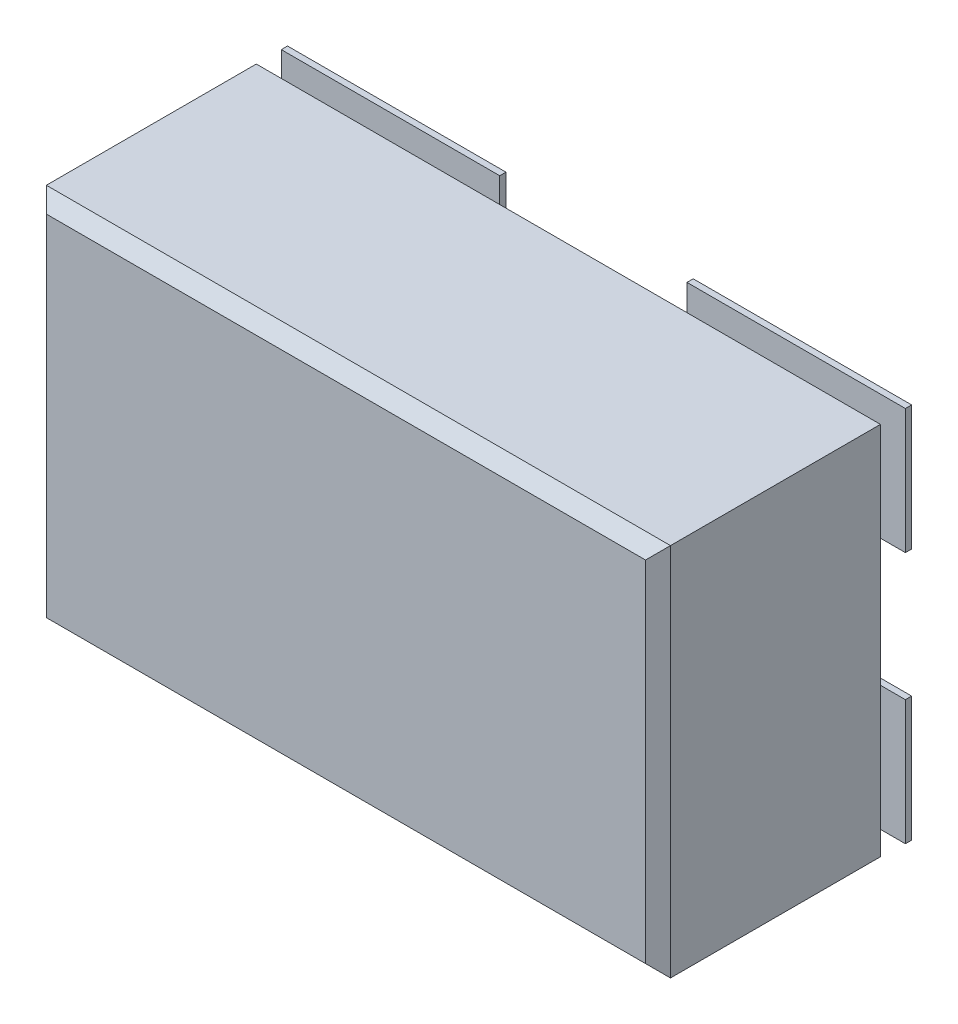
ISO-10303-21;
HEADER;
FILE_DESCRIPTION(('STEP AP214'),'2;1');
FILE_NAME('part.step','',(''),(''),'','','');
FILE_SCHEMA(('AUTOMOTIVE_DESIGN { 1 0 10303 214 1 1 1 1 }'));
ENDSEC;
DATA;
#1=APPLICATION_CONTEXT('core data for automotive mechanical design processes');
#2=APPLICATION_PROTOCOL_DEFINITION('international standard','automotive_design',2000,#1);
#3=PRODUCT_CONTEXT('',#1,'mechanical');
#4=PRODUCT('Part','Part','',(#3));
#5=PRODUCT_RELATED_PRODUCT_CATEGORY('part','',(#4));
#6=PRODUCT_DEFINITION_FORMATION('','',#4);
#7=PRODUCT_DEFINITION_CONTEXT('part definition',#1,'design');
#8=PRODUCT_DEFINITION('design','',#6,#7);
#9=PRODUCT_DEFINITION_SHAPE('','',#8);
#10=(LENGTH_UNIT() NAMED_UNIT(*) SI_UNIT(.MILLI.,.METRE.));
#11=(NAMED_UNIT(*) PLANE_ANGLE_UNIT() SI_UNIT($,.RADIAN.));
#12=(NAMED_UNIT(*) SI_UNIT($,.STERADIAN.) SOLID_ANGLE_UNIT());
#13=UNCERTAINTY_MEASURE_WITH_UNIT(LENGTH_MEASURE(1.E-05),#10,'distance_accuracy_value','');
#14=(GEOMETRIC_REPRESENTATION_CONTEXT(3) GLOBAL_UNCERTAINTY_ASSIGNED_CONTEXT((#13)) GLOBAL_UNIT_ASSIGNED_CONTEXT((#10,
#11,#12)) REPRESENTATION_CONTEXT('',''));
#15=CARTESIAN_POINT('',(0.,0.,0.));
#16=DIRECTION('',(0.,0.,1.));
#17=DIRECTION('',(1.,0.,0.));
#18=AXIS2_PLACEMENT_3D('',#15,#16,#17);
#19=CARTESIAN_POINT('',(0.,0.,0.0762));
#20=DIRECTION('',(0.,0.,1.));
#21=DIRECTION('',(1.,0.,0.));
#22=AXIS2_PLACEMENT_3D('',#19,#20,#21);
#23=PLANE('',#22);
#24=DIRECTION('',(1.,0.,0.));
#25=VECTOR('',#24,1.);
#26=CARTESIAN_POINT('',(-0.500000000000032,-0.30000000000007,0.0762));
#27=LINE('',#26,#25);
#28=CARTESIAN_POINT('',(-0.500000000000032,-0.30000000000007,0.0762));
#29=VERTEX_POINT('',#28);
#30=CARTESIAN_POINT('',(-0.15000000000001,-0.30000000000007,0.0762));
#31=VERTEX_POINT('',#30);
#32=EDGE_CURVE('E504',#29,#31,#27,.T.);
#33=ORIENTED_EDGE('',*,*,#32,.F.);
#34=DIRECTION('',(0.,1.,0.));
#35=VECTOR('',#34,1.);
#36=CARTESIAN_POINT('',(-0.500000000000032,0.30000000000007,0.0762));
#37=LINE('',#36,#35);
#38=CARTESIAN_POINT('',(-0.500000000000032,0.30000000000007,0.0762));
#39=VERTEX_POINT('',#38);
#40=EDGE_CURVE('E509',#39,#29,#37,.F.);
#41=ORIENTED_EDGE('',*,*,#40,.F.);
#42=DIRECTION('',(1.,0.,0.));
#43=VECTOR('',#42,1.);
#44=CARTESIAN_POINT('',(-0.15000000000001,0.30000000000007,0.0762));
#45=LINE('',#44,#43);
#46=CARTESIAN_POINT('',(-0.15000000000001,0.30000000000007,0.0762));
#47=VERTEX_POINT('',#46);
#48=EDGE_CURVE('E471',#47,#39,#45,.F.);
#49=ORIENTED_EDGE('',*,*,#48,.F.);
#50=DIRECTION('',(0.,1.,0.));
#51=VECTOR('',#50,1.);
#52=CARTESIAN_POINT('',(-0.15000000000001,-0.30000000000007,0.0762));
#53=LINE('',#52,#51);
#54=EDGE_CURVE('E499',#31,#47,#53,.T.);
#55=ORIENTED_EDGE('',*,*,#54,.F.);
#56=EDGE_LOOP('',(#33,#41,#49,#55));
#57=FACE_BOUND('',#56,.T.);
#58=ADVANCED_FACE('F16',(#57),#23,.F.);
#59=CARTESIAN_POINT('',(-0.500000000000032,0.30000000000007,0.0762));
#60=DIRECTION('',(-1.,0.,0.));
#61=DIRECTION('',(0.,0.,1.));
#62=AXIS2_PLACEMENT_3D('',#59,#60,#61);
#63=PLANE('',#62);
#64=DIRECTION('',(0.,0.,1.));
#65=VECTOR('',#64,1.);
#66=CARTESIAN_POINT('',(-0.500000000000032,0.30000000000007,0.0762));
#67=LINE('',#66,#65);
#68=CARTESIAN_POINT('',(-0.500000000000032,0.30000000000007,0.0862000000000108));
#69=VERTEX_POINT('',#68);
#70=EDGE_CURVE('E496',#39,#69,#67,.T.);
#71=ORIENTED_EDGE('',*,*,#70,.F.);
#72=ORIENTED_EDGE('',*,*,#40,.T.);
#73=DIRECTION('',(0.,0.,-1.));
#74=VECTOR('',#73,1.);
#75=CARTESIAN_POINT('',(-0.500000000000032,-0.30000000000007,0.0762));
#76=LINE('',#75,#74);
#77=CARTESIAN_POINT('',(-0.500000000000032,-0.30000000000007,0.0862000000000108));
#78=VERTEX_POINT('',#77);
#79=EDGE_CURVE('E506',#78,#29,#76,.T.);
#80=ORIENTED_EDGE('',*,*,#79,.F.);
#81=DIRECTION('',(0.,1.,0.));
#82=VECTOR('',#81,1.);
#83=CARTESIAN_POINT('',(-0.500000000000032,0.,0.0862000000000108));
#84=LINE('',#83,#82);
#85=EDGE_CURVE('E406',#69,#78,#84,.F.);
#86=ORIENTED_EDGE('',*,*,#85,.F.);
#87=EDGE_LOOP('',(#71,#72,#80,#86));
#88=FACE_BOUND('',#87,.T.);
#89=ADVANCED_FACE('F1031',(#88),#63,.T.);
#90=CARTESIAN_POINT('',(-0.500000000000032,-0.30000000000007,0.0762));
#91=DIRECTION('',(0.,-1.,0.));
#92=DIRECTION('',(0.,0.,-1.));
#93=AXIS2_PLACEMENT_3D('',#90,#91,#92);
#94=PLANE('',#93);
#95=ORIENTED_EDGE('',*,*,#79,.T.);
#96=ORIENTED_EDGE('',*,*,#32,.T.);
#97=DIRECTION('',(0.,0.,-1.));
#98=VECTOR('',#97,1.);
#99=CARTESIAN_POINT('',(-0.15000000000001,-0.30000000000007,0.0762));
#100=LINE('',#99,#98);
#101=CARTESIAN_POINT('',(-0.15000000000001,-0.30000000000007,0.0862000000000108));
#102=VERTEX_POINT('',#101);
#103=EDGE_CURVE('E501',#102,#31,#100,.T.);
#104=ORIENTED_EDGE('',*,*,#103,.F.);
#105=DIRECTION('',(1.,0.,0.));
#106=VECTOR('',#105,1.);
#107=CARTESIAN_POINT('',(0.,-0.30000000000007,0.0862000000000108));
#108=LINE('',#107,#106);
#109=EDGE_CURVE('E403',#78,#102,#108,.T.);
#110=ORIENTED_EDGE('',*,*,#109,.F.);
#111=EDGE_LOOP('',(#95,#96,#104,#110));
#112=FACE_BOUND('',#111,.T.);
#113=ADVANCED_FACE('F1021',(#112),#94,.T.);
#114=CARTESIAN_POINT('',(-0.15000000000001,-0.30000000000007,0.0762));
#115=DIRECTION('',(1.,0.,0.));
#116=DIRECTION('',(0.,0.,-1.));
#117=AXIS2_PLACEMENT_3D('',#114,#115,#116);
#118=PLANE('',#117);
#119=ORIENTED_EDGE('',*,*,#103,.T.);
#120=ORIENTED_EDGE('',*,*,#54,.T.);
#121=DIRECTION('',(0.,0.,1.));
#122=VECTOR('',#121,1.);
#123=CARTESIAN_POINT('',(-0.15000000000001,0.30000000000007,0.0762));
#124=LINE('',#123,#122);
#125=CARTESIAN_POINT('',(-0.15000000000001,0.30000000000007,0.0862000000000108));
#126=VERTEX_POINT('',#125);
#127=EDGE_CURVE('E493',#126,#47,#124,.F.);
#128=ORIENTED_EDGE('',*,*,#127,.F.);
#129=DIRECTION('',(0.,1.,0.));
#130=VECTOR('',#129,1.);
#131=CARTESIAN_POINT('',(-0.15000000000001,0.,0.0862000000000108));
#132=LINE('',#131,#130);
#133=EDGE_CURVE('E400',#102,#126,#132,.T.);
#134=ORIENTED_EDGE('',*,*,#133,.F.);
#135=EDGE_LOOP('',(#119,#120,#128,#134));
#136=FACE_BOUND('',#135,.T.);
#137=ADVANCED_FACE('F1011',(#136),#118,.T.);
#138=CARTESIAN_POINT('',(-0.15000000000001,0.30000000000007,0.0762));
#139=DIRECTION('',(0.,1.,0.));
#140=DIRECTION('',(0.,0.,1.));
#141=AXIS2_PLACEMENT_3D('',#138,#139,#140);
#142=PLANE('',#141);
#143=ORIENTED_EDGE('',*,*,#127,.T.);
#144=ORIENTED_EDGE('',*,*,#48,.T.);
#145=ORIENTED_EDGE('',*,*,#70,.T.);
#146=DIRECTION('',(1.,0.,0.));
#147=VECTOR('',#146,1.);
#148=CARTESIAN_POINT('',(0.,0.30000000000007,0.0862000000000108));
#149=LINE('',#148,#147);
#150=EDGE_CURVE('E396',#126,#69,#149,.F.);
#151=ORIENTED_EDGE('',*,*,#150,.F.);
#152=EDGE_LOOP('',(#143,#144,#145,#151));
#153=FACE_BOUND('',#152,.T.);
#154=ADVANCED_FACE('F1001',(#153),#142,.T.);
#155=CARTESIAN_POINT('',(0.500000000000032,0.101999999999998,0.0762));
#156=DIRECTION('',(1.,0.,0.));
#157=DIRECTION('',(0.,0.,-1.));
#158=AXIS2_PLACEMENT_3D('',#155,#156,#157);
#159=PLANE('',#158);
#160=DIRECTION('',(0.,0.,-1.));
#161=VECTOR('',#160,1.);
#162=CARTESIAN_POINT('',(0.500000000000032,0.101999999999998,0.0762));
#163=LINE('',#162,#161);
#164=CARTESIAN_POINT('',(0.500000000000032,0.101999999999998,0.0762));
#165=VERTEX_POINT('',#164);
#166=CARTESIAN_POINT('',(0.500000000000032,0.101999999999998,0.0862000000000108));
#167=VERTEX_POINT('',#166);
#168=EDGE_CURVE('E399',#165,#167,#163,.F.);
#169=ORIENTED_EDGE('',*,*,#168,.F.);
#170=DIRECTION('',(0.,1.,0.));
#171=VECTOR('',#170,1.);
#172=CARTESIAN_POINT('',(0.500000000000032,0.,0.0762));
#173=LINE('',#172,#171);
#174=CARTESIAN_POINT('',(0.500000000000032,0.302000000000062,0.0762));
#175=VERTEX_POINT('',#174);
#176=EDGE_CURVE('E247',#165,#175,#173,.T.);
#177=ORIENTED_EDGE('',*,*,#176,.T.);
#178=DIRECTION('',(0.,0.,1.));
#179=VECTOR('',#178,1.);
#180=CARTESIAN_POINT('',(0.500000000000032,0.302000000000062,0.0762));
#181=LINE('',#180,#179);
#182=CARTESIAN_POINT('',(0.500000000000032,0.302000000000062,0.0862000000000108));
#183=VERTEX_POINT('',#182);
#184=EDGE_CURVE('E462',#183,#175,#181,.F.);
#185=ORIENTED_EDGE('',*,*,#184,.F.);
#186=DIRECTION('',(0.,1.,0.));
#187=VECTOR('',#186,1.);
#188=CARTESIAN_POINT('',(0.500000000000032,0.,0.0862000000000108));
#189=LINE('',#188,#187);
#190=EDGE_CURVE('E389',#167,#183,#189,.T.);
#191=ORIENTED_EDGE('',*,*,#190,.F.);
#192=EDGE_LOOP('',(#169,#177,#185,#191));
#193=FACE_BOUND('',#192,.T.);
#194=ADVANCED_FACE('F991',(#193),#159,.T.);
#195=CARTESIAN_POINT('',(0.500000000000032,0.302000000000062,0.0762));
#196=DIRECTION('',(0.,1.,0.));
#197=DIRECTION('',(0.,0.,1.));
#198=AXIS2_PLACEMENT_3D('',#195,#196,#197);
#199=PLANE('',#198);
#200=ORIENTED_EDGE('',*,*,#184,.T.);
#201=DIRECTION('',(1.,0.,0.));
#202=VECTOR('',#201,1.);
#203=CARTESIAN_POINT('',(0.,0.302000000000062,0.0762));
#204=LINE('',#203,#202);
#205=CARTESIAN_POINT('',(0.15000000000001,0.302000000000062,0.0762));
#206=VERTEX_POINT('',#205);
#207=EDGE_CURVE('E482',#175,#206,#204,.F.);
#208=ORIENTED_EDGE('',*,*,#207,.T.);
#209=DIRECTION('',(0.,0.,1.));
#210=VECTOR('',#209,1.);
#211=CARTESIAN_POINT('',(0.15000000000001,0.302000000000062,0.0762));
#212=LINE('',#211,#210);
#213=CARTESIAN_POINT('',(0.15000000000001,0.302000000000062,0.0862000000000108));
#214=VERTEX_POINT('',#213);
#215=EDGE_CURVE('E431',#214,#206,#212,.F.);
#216=ORIENTED_EDGE('',*,*,#215,.F.);
#217=DIRECTION('',(1.,0.,0.));
#218=VECTOR('',#217,1.);
#219=CARTESIAN_POINT('',(0.,0.302000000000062,0.0862000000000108));
#220=LINE('',#219,#218);
#221=EDGE_CURVE('E457',#183,#214,#220,.F.);
#222=ORIENTED_EDGE('',*,*,#221,.F.);
#223=EDGE_LOOP('',(#200,#208,#216,#222));
#224=FACE_BOUND('',#223,.T.);
#225=ADVANCED_FACE('F981',(#224),#199,.T.);
#226=CARTESIAN_POINT('',(0.15000000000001,0.302000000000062,0.0762));
#227=DIRECTION('',(-1.,0.,0.));
#228=DIRECTION('',(0.,0.,1.));
#229=AXIS2_PLACEMENT_3D('',#226,#227,#228);
#230=PLANE('',#229);
#231=ORIENTED_EDGE('',*,*,#215,.T.);
#232=DIRECTION('',(0.,1.,0.));
#233=VECTOR('',#232,1.);
#234=CARTESIAN_POINT('',(0.15000000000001,0.,0.0762));
#235=LINE('',#234,#233);
#236=CARTESIAN_POINT('',(0.15000000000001,0.101999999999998,0.0762));
#237=VERTEX_POINT('',#236);
#238=EDGE_CURVE('E365',#206,#237,#235,.F.);
#239=ORIENTED_EDGE('',*,*,#238,.T.);
#240=DIRECTION('',(0.,0.,-1.));
#241=VECTOR('',#240,1.);
#242=CARTESIAN_POINT('',(0.15000000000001,0.101999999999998,0.0762));
#243=LINE('',#242,#241);
#244=CARTESIAN_POINT('',(0.15000000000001,0.101999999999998,0.0862000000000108));
#245=VERTEX_POINT('',#244);
#246=EDGE_CURVE('E249',#245,#237,#243,.T.);
#247=ORIENTED_EDGE('',*,*,#246,.F.);
#248=DIRECTION('',(0.,1.,0.));
#249=VECTOR('',#248,1.);
#250=CARTESIAN_POINT('',(0.15000000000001,0.,0.0862000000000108));
#251=LINE('',#250,#249);
#252=EDGE_CURVE('E374',#214,#245,#251,.F.);
#253=ORIENTED_EDGE('',*,*,#252,.F.);
#254=EDGE_LOOP('',(#231,#239,#247,#253));
#255=FACE_BOUND('',#254,.T.);
#256=ADVANCED_FACE('F971',(#255),#230,.T.);
#257=CARTESIAN_POINT('',(0.15000000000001,-0.101999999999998,0.0762));
#258=DIRECTION('',(-1.,0.,0.));
#259=DIRECTION('',(0.,0.,1.));
#260=AXIS2_PLACEMENT_3D('',#257,#258,#259);
#261=PLANE('',#260);
#262=DIRECTION('',(0.,0.,1.));
#263=VECTOR('',#262,1.);
#264=CARTESIAN_POINT('',(0.15000000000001,-0.101999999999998,0.0762));
#265=LINE('',#264,#263);
#266=CARTESIAN_POINT('',(0.15000000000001,-0.101999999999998,0.0762));
#267=VERTEX_POINT('',#266);
#268=CARTESIAN_POINT('',(0.15000000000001,-0.101999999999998,0.0862000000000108));
#269=VERTEX_POINT('',#268);
#270=EDGE_CURVE('E295',#267,#269,#265,.T.);
#271=ORIENTED_EDGE('',*,*,#270,.F.);
#272=DIRECTION('',(0.,1.,0.));
#273=VECTOR('',#272,1.);
#274=CARTESIAN_POINT('',(0.15000000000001,0.,0.0762));
#275=LINE('',#274,#273);
#276=CARTESIAN_POINT('',(0.15000000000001,-0.302000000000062,0.0762));
#277=VERTEX_POINT('',#276);
#278=EDGE_CURVE('E412',#267,#277,#275,.F.);
#279=ORIENTED_EDGE('',*,*,#278,.T.);
#280=DIRECTION('',(0.,0.,-1.));
#281=VECTOR('',#280,1.);
#282=CARTESIAN_POINT('',(0.15000000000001,-0.302000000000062,0.0762));
#283=LINE('',#282,#281);
#284=CARTESIAN_POINT('',(0.15000000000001,-0.302000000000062,0.0862000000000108));
#285=VERTEX_POINT('',#284);
#286=EDGE_CURVE('E422',#285,#277,#283,.T.);
#287=ORIENTED_EDGE('',*,*,#286,.F.);
#288=DIRECTION('',(0.,1.,0.));
#289=VECTOR('',#288,1.);
#290=CARTESIAN_POINT('',(0.15000000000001,0.,0.0862000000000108));
#291=LINE('',#290,#289);
#292=EDGE_CURVE('E308',#269,#285,#291,.F.);
#293=ORIENTED_EDGE('',*,*,#292,.F.);
#294=EDGE_LOOP('',(#271,#279,#287,#293));
#295=FACE_BOUND('',#294,.T.);
#296=ADVANCED_FACE('F961',(#295),#261,.T.);
#297=CARTESIAN_POINT('',(0.15000000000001,-0.302000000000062,0.0762));
#298=DIRECTION('',(0.,-1.,0.));
#299=DIRECTION('',(0.,0.,-1.));
#300=AXIS2_PLACEMENT_3D('',#297,#298,#299);
#301=PLANE('',#300);
#302=ORIENTED_EDGE('',*,*,#286,.T.);
#303=DIRECTION('',(1.,0.,0.));
#304=VECTOR('',#303,1.);
#305=CARTESIAN_POINT('',(0.,-0.302000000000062,0.0762));
#306=LINE('',#305,#304);
#307=CARTESIAN_POINT('',(0.500000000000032,-0.302000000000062,0.0762));
#308=VERTEX_POINT('',#307);
#309=EDGE_CURVE('E442',#277,#308,#306,.T.);
#310=ORIENTED_EDGE('',*,*,#309,.T.);
#311=DIRECTION('',(0.,0.,-1.));
#312=VECTOR('',#311,1.);
#313=CARTESIAN_POINT('',(0.500000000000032,-0.302000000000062,0.0762));
#314=LINE('',#313,#312);
#315=CARTESIAN_POINT('',(0.500000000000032,-0.302000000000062,0.0862000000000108));
#316=VERTEX_POINT('',#315);
#317=EDGE_CURVE('E409',#316,#308,#314,.T.);
#318=ORIENTED_EDGE('',*,*,#317,.F.);
#319=DIRECTION('',(1.,0.,0.));
#320=VECTOR('',#319,1.);
#321=CARTESIAN_POINT('',(0.,-0.302000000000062,0.0862000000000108));
#322=LINE('',#321,#320);
#323=EDGE_CURVE('E417',#285,#316,#322,.T.);
#324=ORIENTED_EDGE('',*,*,#323,.F.);
#325=EDGE_LOOP('',(#302,#310,#318,#324));
#326=FACE_BOUND('',#325,.T.);
#327=ADVANCED_FACE('F951',(#326),#301,.T.);
#328=CARTESIAN_POINT('',(0.500000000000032,-0.302000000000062,0.0762));
#329=DIRECTION('',(1.,0.,0.));
#330=DIRECTION('',(0.,0.,-1.));
#331=AXIS2_PLACEMENT_3D('',#328,#329,#330);
#332=PLANE('',#331);
#333=ORIENTED_EDGE('',*,*,#317,.T.);
#334=DIRECTION('',(0.,1.,0.));
#335=VECTOR('',#334,1.);
#336=CARTESIAN_POINT('',(0.500000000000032,0.,0.0762));
#337=LINE('',#336,#335);
#338=CARTESIAN_POINT('',(0.500000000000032,-0.101999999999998,0.0762));
#339=VERTEX_POINT('',#338);
#340=EDGE_CURVE('E312',#308,#339,#337,.T.);
#341=ORIENTED_EDGE('',*,*,#340,.T.);
#342=DIRECTION('',(0.,0.,1.));
#343=VECTOR('',#342,1.);
#344=CARTESIAN_POINT('',(0.500000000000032,-0.101999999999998,0.0762));
#345=LINE('',#344,#343);
#346=CARTESIAN_POINT('',(0.500000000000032,-0.101999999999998,0.0862000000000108));
#347=VERTEX_POINT('',#346);
#348=EDGE_CURVE('E373',#347,#339,#345,.F.);
#349=ORIENTED_EDGE('',*,*,#348,.F.);
#350=DIRECTION('',(0.,1.,0.));
#351=VECTOR('',#350,1.);
#352=CARTESIAN_POINT('',(0.500000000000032,0.,0.0862000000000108));
#353=LINE('',#352,#351);
#354=EDGE_CURVE('E343',#316,#347,#353,.T.);
#355=ORIENTED_EDGE('',*,*,#354,.F.);
#356=EDGE_LOOP('',(#333,#341,#349,#355));
#357=FACE_BOUND('',#356,.T.);
#358=ADVANCED_FACE('F941',(#357),#332,.T.);
#359=CARTESIAN_POINT('',(0.,0.,0.0862000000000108));
#360=DIRECTION('',(0.,0.,1.));
#361=DIRECTION('',(1.,0.,0.));
#362=AXIS2_PLACEMENT_3D('',#359,#360,#361);
#363=PLANE('',#362);
#364=DIRECTION('',(1.,0.,0.));
#365=VECTOR('',#364,1.);
#366=CARTESIAN_POINT('',(-0.449999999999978,-0.249999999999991,0.0862000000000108));
#367=LINE('',#366,#365);
#368=CARTESIAN_POINT('',(-0.449999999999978,-0.249999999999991,0.0862000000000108));
#369=VERTEX_POINT('',#368);
#370=CARTESIAN_POINT('',(-0.199999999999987,-0.249999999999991,0.0862000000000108));
#371=VERTEX_POINT('',#370);
#372=EDGE_CURVE('E289',#369,#371,#367,.T.);
#373=ORIENTED_EDGE('',*,*,#372,.F.);
#374=DIRECTION('',(0.,1.,0.));
#375=VECTOR('',#374,1.);
#376=CARTESIAN_POINT('',(-0.449999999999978,0.249999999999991,0.0862000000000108));
#377=LINE('',#376,#375);
#378=CARTESIAN_POINT('',(-0.449999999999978,0.249999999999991,0.0862000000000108));
#379=VERTEX_POINT('',#378);
#380=EDGE_CURVE('E264',#379,#369,#377,.F.);
#381=ORIENTED_EDGE('',*,*,#380,.F.);
#382=DIRECTION('',(1.,0.,0.));
#383=VECTOR('',#382,1.);
#384=CARTESIAN_POINT('',(-0.199999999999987,0.249999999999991,0.0862000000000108));
#385=LINE('',#384,#383);
#386=CARTESIAN_POINT('',(-0.199999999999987,0.249999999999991,0.0862000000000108));
#387=VERTEX_POINT('',#386);
#388=EDGE_CURVE('E279',#387,#379,#385,.F.);
#389=ORIENTED_EDGE('',*,*,#388,.F.);
#390=DIRECTION('',(0.,1.,0.));
#391=VECTOR('',#390,1.);
#392=CARTESIAN_POINT('',(-0.199999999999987,-0.249999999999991,0.0862000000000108));
#393=LINE('',#392,#391);
#394=EDGE_CURVE('E284',#371,#387,#393,.T.);
#395=ORIENTED_EDGE('',*,*,#394,.F.);
#396=EDGE_LOOP('',(#373,#381,#389,#395));
#397=FACE_BOUND('',#396,.T.);
#398=ORIENTED_EDGE('',*,*,#133,.T.);
#399=ORIENTED_EDGE('',*,*,#150,.T.);
#400=ORIENTED_EDGE('',*,*,#85,.T.);
#401=ORIENTED_EDGE('',*,*,#109,.T.);
#402=EDGE_LOOP('',(#398,#399,#400,#401));
#403=FACE_BOUND('',#402,.T.);
#404=ADVANCED_FACE('F932',(#397,#403),#363,.T.);
#405=CARTESIAN_POINT('',(0.15000000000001,0.101999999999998,0.0762));
#406=DIRECTION('',(0.,-1.,0.));
#407=DIRECTION('',(0.,0.,-1.));
#408=AXIS2_PLACEMENT_3D('',#405,#406,#407);
#409=PLANE('',#408);
#410=DIRECTION('',(1.,0.,0.));
#411=VECTOR('',#410,1.);
#412=CARTESIAN_POINT('',(0.,0.101999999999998,0.0862000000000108));
#413=LINE('',#412,#411);
#414=CARTESIAN_POINT('',(0.449999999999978,0.101999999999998,0.0862000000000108));
#415=VERTEX_POINT('',#414);
#416=EDGE_CURVE('E255',#415,#167,#413,.T.);
#417=ORIENTED_EDGE('',*,*,#416,.F.);
#418=DIRECTION('',(0.,0.,-1.));
#419=VECTOR('',#418,1.);
#420=CARTESIAN_POINT('',(0.449999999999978,0.101999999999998,0.0762));
#421=LINE('',#420,#419);
#422=CARTESIAN_POINT('',(0.449999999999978,0.101999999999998,0.0762));
#423=VERTEX_POINT('',#422);
#424=EDGE_CURVE('E252',#423,#415,#421,.F.);
#425=ORIENTED_EDGE('',*,*,#424,.F.);
#426=DIRECTION('',(1.,0.,0.));
#427=VECTOR('',#426,1.);
#428=CARTESIAN_POINT('',(0.,0.101999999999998,0.0762));
#429=LINE('',#428,#427);
#430=EDGE_CURVE('E240',#423,#165,#429,.T.);
#431=ORIENTED_EDGE('',*,*,#430,.T.);
#432=ORIENTED_EDGE('',*,*,#168,.T.);
#433=EDGE_LOOP('',(#417,#425,#431,#432));
#434=FACE_BOUND('',#433,.T.);
#435=ADVANCED_FACE('F253',(#434),#409,.T.);
#436=CARTESIAN_POINT('',(0.15000000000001,0.101999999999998,0.0762));
#437=DIRECTION('',(0.,-1.,0.));
#438=DIRECTION('',(0.,0.,-1.));
#439=AXIS2_PLACEMENT_3D('',#436,#437,#438);
#440=PLANE('',#439);
#441=DIRECTION('',(1.,0.,0.));
#442=VECTOR('',#441,1.);
#443=CARTESIAN_POINT('',(0.,0.101999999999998,0.0762));
#444=LINE('',#443,#442);
#445=CARTESIAN_POINT('',(0.199999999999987,0.101999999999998,0.0762));
#446=VERTEX_POINT('',#445);
#447=EDGE_CURVE('E363',#237,#446,#444,.T.);
#448=ORIENTED_EDGE('',*,*,#447,.T.);
#449=DIRECTION('',(0.,0.,1.));
#450=VECTOR('',#449,1.);
#451=CARTESIAN_POINT('',(0.199999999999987,0.101999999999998,0.0762));
#452=LINE('',#451,#450);
#453=CARTESIAN_POINT('',(0.199999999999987,0.101999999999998,0.0862000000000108));
#454=VERTEX_POINT('',#453);
#455=EDGE_CURVE('E517',#454,#446,#452,.F.);
#456=ORIENTED_EDGE('',*,*,#455,.F.);
#457=DIRECTION('',(1.,0.,0.));
#458=VECTOR('',#457,1.);
#459=CARTESIAN_POINT('',(0.,0.101999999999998,0.0862000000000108));
#460=LINE('',#459,#458);
#461=EDGE_CURVE('E370',#245,#454,#460,.T.);
#462=ORIENTED_EDGE('',*,*,#461,.F.);
#463=ORIENTED_EDGE('',*,*,#246,.T.);
#464=EDGE_LOOP('',(#448,#456,#462,#463));
#465=FACE_BOUND('',#464,.T.);
#466=ADVANCED_FACE('F914',(#465),#440,.T.);
#467=CARTESIAN_POINT('',(0.,0.,0.0762));
#468=DIRECTION('',(0.,0.,1.));
#469=DIRECTION('',(1.,0.,0.));
#470=AXIS2_PLACEMENT_3D('',#467,#468,#469);
#471=PLANE('',#470);
#472=DIRECTION('',(0.,1.,0.));
#473=VECTOR('',#472,1.);
#474=CARTESIAN_POINT('',(0.199999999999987,0.249999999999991,0.0762));
#475=LINE('',#474,#473);
#476=CARTESIAN_POINT('',(0.199999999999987,0.100000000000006,0.0762));
#477=VERTEX_POINT('',#476);
#478=EDGE_CURVE('E514',#446,#477,#475,.F.);
#479=ORIENTED_EDGE('',*,*,#478,.F.);
#480=ORIENTED_EDGE('',*,*,#447,.F.);
#481=ORIENTED_EDGE('',*,*,#238,.F.);
#482=ORIENTED_EDGE('',*,*,#207,.F.);
#483=ORIENTED_EDGE('',*,*,#176,.F.);
#484=ORIENTED_EDGE('',*,*,#430,.F.);
#485=DIRECTION('',(0.,1.,0.));
#486=VECTOR('',#485,1.);
#487=CARTESIAN_POINT('',(0.449999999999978,0.100000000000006,0.0762));
#488=LINE('',#487,#486);
#489=CARTESIAN_POINT('',(0.449999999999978,0.100000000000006,0.0762));
#490=VERTEX_POINT('',#489);
#491=EDGE_CURVE('E19',#490,#423,#488,.T.);
#492=ORIENTED_EDGE('',*,*,#491,.F.);
#493=DIRECTION('',(1.,0.,0.));
#494=VECTOR('',#493,1.);
#495=CARTESIAN_POINT('',(0.199999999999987,0.100000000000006,0.0762));
#496=LINE('',#495,#494);
#497=EDGE_CURVE('E234',#477,#490,#496,.T.);
#498=ORIENTED_EDGE('',*,*,#497,.F.);
#499=EDGE_LOOP('',(#479,#480,#481,#482,#483,#484,#492,#498));
#500=FACE_BOUND('',#499,.T.);
#501=ADVANCED_FACE('F243',(#500),#471,.F.);
#502=CARTESIAN_POINT('',(0.,0.,0.0862000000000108));
#503=DIRECTION('',(0.,0.,1.));
#504=DIRECTION('',(1.,0.,0.));
#505=AXIS2_PLACEMENT_3D('',#502,#503,#504);
#506=PLANE('',#505);
#507=ORIENTED_EDGE('',*,*,#461,.T.);
#508=DIRECTION('',(0.,1.,0.));
#509=VECTOR('',#508,1.);
#510=CARTESIAN_POINT('',(0.199999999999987,0.249999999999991,0.0862000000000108));
#511=LINE('',#510,#509);
#512=CARTESIAN_POINT('',(0.199999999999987,0.249999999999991,0.0862000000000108));
#513=VERTEX_POINT('',#512);
#514=EDGE_CURVE('E377',#513,#454,#511,.F.);
#515=ORIENTED_EDGE('',*,*,#514,.F.);
#516=DIRECTION('',(1.,0.,0.));
#517=VECTOR('',#516,1.);
#518=CARTESIAN_POINT('',(0.449999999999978,0.249999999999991,0.0862000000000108));
#519=LINE('',#518,#517);
#520=CARTESIAN_POINT('',(0.449999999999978,0.249999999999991,0.0862000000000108));
#521=VERTEX_POINT('',#520);
#522=EDGE_CURVE('E522',#521,#513,#519,.F.);
#523=ORIENTED_EDGE('',*,*,#522,.F.);
#524=DIRECTION('',(0.,1.,0.));
#525=VECTOR('',#524,1.);
#526=CARTESIAN_POINT('',(0.449999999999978,0.100000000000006,0.0862000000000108));
#527=LINE('',#526,#525);
#528=EDGE_CURVE('E258',#415,#521,#527,.T.);
#529=ORIENTED_EDGE('',*,*,#528,.F.);
#530=ORIENTED_EDGE('',*,*,#416,.T.);
#531=ORIENTED_EDGE('',*,*,#190,.T.);
#532=ORIENTED_EDGE('',*,*,#221,.T.);
#533=ORIENTED_EDGE('',*,*,#252,.T.);
#534=EDGE_LOOP('',(#507,#515,#523,#529,#530,#531,#532,#533));
#535=FACE_BOUND('',#534,.T.);
#536=ADVANCED_FACE('F538',(#535),#506,.T.);
#537=CARTESIAN_POINT('',(0.500000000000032,-0.101999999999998,0.0762));
#538=DIRECTION('',(0.,1.,0.));
#539=DIRECTION('',(0.,0.,1.));
#540=AXIS2_PLACEMENT_3D('',#537,#538,#539);
#541=PLANE('',#540);
#542=DIRECTION('',(1.,0.,0.));
#543=VECTOR('',#542,1.);
#544=CARTESIAN_POINT('',(0.,-0.101999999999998,0.0762));
#545=LINE('',#544,#543);
#546=CARTESIAN_POINT('',(0.449999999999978,-0.101999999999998,0.0762));
#547=VERTEX_POINT('',#546);
#548=EDGE_CURVE('E296',#339,#547,#545,.F.);
#549=ORIENTED_EDGE('',*,*,#548,.T.);
#550=DIRECTION('',(0.,0.,-1.));
#551=VECTOR('',#550,1.);
#552=CARTESIAN_POINT('',(0.449999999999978,-0.101999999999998,0.0762));
#553=LINE('',#552,#551);
#554=CARTESIAN_POINT('',(0.449999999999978,-0.101999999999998,0.0862000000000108));
#555=VERTEX_POINT('',#554);
#556=EDGE_CURVE('E380',#555,#547,#553,.T.);
#557=ORIENTED_EDGE('',*,*,#556,.F.);
#558=DIRECTION('',(1.,0.,0.));
#559=VECTOR('',#558,1.);
#560=CARTESIAN_POINT('',(0.,-0.101999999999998,0.0862000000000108));
#561=LINE('',#560,#559);
#562=EDGE_CURVE('E291',#347,#555,#561,.F.);
#563=ORIENTED_EDGE('',*,*,#562,.F.);
#564=ORIENTED_EDGE('',*,*,#348,.T.);
#565=EDGE_LOOP('',(#549,#557,#563,#564));
#566=FACE_BOUND('',#565,.T.);
#567=ADVANCED_FACE('F887',(#566),#541,.T.);
#568=CARTESIAN_POINT('',(0.,0.,0.0762));
#569=DIRECTION('',(0.,0.,1.));
#570=DIRECTION('',(1.,0.,0.));
#571=AXIS2_PLACEMENT_3D('',#568,#569,#570);
#572=PLANE('',#571);
#573=DIRECTION('',(0.,1.,0.));
#574=VECTOR('',#573,1.);
#575=CARTESIAN_POINT('',(0.449999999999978,-0.249999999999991,0.0762));
#576=LINE('',#575,#574);
#577=CARTESIAN_POINT('',(0.449999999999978,-0.100000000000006,0.0762));
#578=VERTEX_POINT('',#577);
#579=EDGE_CURVE('E348',#547,#578,#576,.T.);
#580=ORIENTED_EDGE('',*,*,#579,.F.);
#581=ORIENTED_EDGE('',*,*,#548,.F.);
#582=ORIENTED_EDGE('',*,*,#340,.F.);
#583=ORIENTED_EDGE('',*,*,#309,.F.);
#584=ORIENTED_EDGE('',*,*,#278,.F.);
#585=DIRECTION('',(1.,0.,0.));
#586=VECTOR('',#585,1.);
#587=CARTESIAN_POINT('',(0.500000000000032,-0.101999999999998,0.0762));
#588=LINE('',#587,#586);
#589=CARTESIAN_POINT('',(0.199999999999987,-0.101999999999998,0.0762));
#590=VERTEX_POINT('',#589);
#591=EDGE_CURVE('E292',#590,#267,#588,.F.);
#592=ORIENTED_EDGE('',*,*,#591,.F.);
#593=DIRECTION('',(0.,1.,0.));
#594=VECTOR('',#593,1.);
#595=CARTESIAN_POINT('',(0.199999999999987,-0.100000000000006,0.0762));
#596=LINE('',#595,#594);
#597=CARTESIAN_POINT('',(0.199999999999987,-0.100000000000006,0.0762));
#598=VERTEX_POINT('',#597);
#599=EDGE_CURVE('E511',#598,#590,#596,.F.);
#600=ORIENTED_EDGE('',*,*,#599,.F.);
#601=DIRECTION('',(1.,0.,0.));
#602=VECTOR('',#601,1.);
#603=CARTESIAN_POINT('',(0.449999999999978,-0.100000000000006,0.0762));
#604=LINE('',#603,#602);
#605=EDGE_CURVE('E315',#578,#598,#604,.F.);
#606=ORIENTED_EDGE('',*,*,#605,.F.);
#607=EDGE_LOOP('',(#580,#581,#582,#583,#584,#592,#600,#606));
#608=FACE_BOUND('',#607,.T.);
#609=ADVANCED_FACE('F877',(#608),#572,.F.);
#610=CARTESIAN_POINT('',(0.500000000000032,-0.101999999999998,0.0762));
#611=DIRECTION('',(0.,1.,0.));
#612=DIRECTION('',(0.,0.,1.));
#613=AXIS2_PLACEMENT_3D('',#610,#611,#612);
#614=PLANE('',#613);
#615=DIRECTION('',(1.,0.,0.));
#616=VECTOR('',#615,1.);
#617=CARTESIAN_POINT('',(0.,-0.101999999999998,0.0862000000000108));
#618=LINE('',#617,#616);
#619=CARTESIAN_POINT('',(0.199999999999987,-0.101999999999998,0.0862000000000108));
#620=VERTEX_POINT('',#619);
#621=EDGE_CURVE('E305',#620,#269,#618,.F.);
#622=ORIENTED_EDGE('',*,*,#621,.F.);
#623=DIRECTION('',(0.,0.,1.));
#624=VECTOR('',#623,1.);
#625=CARTESIAN_POINT('',(0.199999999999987,-0.101999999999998,0.0762));
#626=LINE('',#625,#624);
#627=EDGE_CURVE('E302',#590,#620,#626,.T.);
#628=ORIENTED_EDGE('',*,*,#627,.F.);
#629=ORIENTED_EDGE('',*,*,#591,.T.);
#630=ORIENTED_EDGE('',*,*,#270,.T.);
#631=EDGE_LOOP('',(#622,#628,#629,#630));
#632=FACE_BOUND('',#631,.T.);
#633=ADVANCED_FACE('F867',(#632),#614,.T.);
#634=CARTESIAN_POINT('',(0.,0.,0.0862000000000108));
#635=DIRECTION('',(0.,0.,1.));
#636=DIRECTION('',(1.,0.,0.));
#637=AXIS2_PLACEMENT_3D('',#634,#635,#636);
#638=PLANE('',#637);
#639=DIRECTION('',(0.,1.,0.));
#640=VECTOR('',#639,1.);
#641=CARTESIAN_POINT('',(0.449999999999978,-0.249999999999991,0.0862000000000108));
#642=LINE('',#641,#640);
#643=CARTESIAN_POINT('',(0.449999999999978,-0.249999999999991,0.0862000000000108));
#644=VERTEX_POINT('',#643);
#645=EDGE_CURVE('E333',#644,#555,#642,.T.);
#646=ORIENTED_EDGE('',*,*,#645,.F.);
#647=DIRECTION('',(1.,0.,0.));
#648=VECTOR('',#647,1.);
#649=CARTESIAN_POINT('',(0.199999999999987,-0.249999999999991,0.0862000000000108));
#650=LINE('',#649,#648);
#651=CARTESIAN_POINT('',(0.199999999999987,-0.249999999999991,0.0862000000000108));
#652=VERTEX_POINT('',#651);
#653=EDGE_CURVE('E562',#652,#644,#650,.T.);
#654=ORIENTED_EDGE('',*,*,#653,.F.);
#655=DIRECTION('',(0.,1.,0.));
#656=VECTOR('',#655,1.);
#657=CARTESIAN_POINT('',(0.199999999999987,-0.100000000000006,0.0862000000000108));
#658=LINE('',#657,#656);
#659=EDGE_CURVE('E299',#620,#652,#658,.F.);
#660=ORIENTED_EDGE('',*,*,#659,.F.);
#661=ORIENTED_EDGE('',*,*,#621,.T.);
#662=ORIENTED_EDGE('',*,*,#292,.T.);
#663=ORIENTED_EDGE('',*,*,#323,.T.);
#664=ORIENTED_EDGE('',*,*,#354,.T.);
#665=ORIENTED_EDGE('',*,*,#562,.T.);
#666=EDGE_LOOP('',(#646,#654,#660,#661,#662,#663,#664,#665));
#667=FACE_BOUND('',#666,.T.);
#668=ADVANCED_FACE('F857',(#667),#638,.T.);
#669=CARTESIAN_POINT('',(-0.449999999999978,-0.249999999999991,0.0762));
#670=DIRECTION('',(0.,-1.,0.));
#671=DIRECTION('',(0.,0.,-1.));
#672=AXIS2_PLACEMENT_3D('',#669,#670,#671);
#673=PLANE('',#672);
#674=DIRECTION('',(0.,0.,1.));
#675=VECTOR('',#674,1.);
#676=CARTESIAN_POINT('',(-0.449999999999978,-0.249999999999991,0.0762));
#677=LINE('',#676,#675);
#678=CARTESIAN_POINT('',(-0.449999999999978,-0.249999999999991,0.126200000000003));
#679=VERTEX_POINT('',#678);
#680=EDGE_CURVE('E276',#369,#679,#677,.T.);
#681=ORIENTED_EDGE('',*,*,#680,.F.);
#682=ORIENTED_EDGE('',*,*,#372,.T.);
#683=DIRECTION('',(0.,0.,-1.));
#684=VECTOR('',#683,1.);
#685=CARTESIAN_POINT('',(-0.199999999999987,-0.249999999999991,0.0762));
#686=LINE('',#685,#684);
#687=CARTESIAN_POINT('',(-0.199999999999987,-0.249999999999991,0.126200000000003));
#688=VERTEX_POINT('',#687);
#689=EDGE_CURVE('E286',#688,#371,#686,.T.);
#690=ORIENTED_EDGE('',*,*,#689,.F.);
#691=DIRECTION('',(-1.,0.,0.));
#692=VECTOR('',#691,1.);
#693=CARTESIAN_POINT('',(-0.500000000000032,-0.249999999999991,0.126200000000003));
#694=LINE('',#693,#692);
#695=EDGE_CURVE('E565',#679,#688,#694,.F.);
#696=ORIENTED_EDGE('',*,*,#695,.F.);
#697=EDGE_LOOP('',(#681,#682,#690,#696));
#698=FACE_BOUND('',#697,.T.);
#699=ADVANCED_FACE('F847',(#698),#673,.T.);
#700=CARTESIAN_POINT('',(-0.199999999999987,-0.249999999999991,0.0762));
#701=DIRECTION('',(1.,0.,0.));
#702=DIRECTION('',(0.,0.,-1.));
#703=AXIS2_PLACEMENT_3D('',#700,#701,#702);
#704=PLANE('',#703);
#705=ORIENTED_EDGE('',*,*,#689,.T.);
#706=ORIENTED_EDGE('',*,*,#394,.T.);
#707=DIRECTION('',(0.,0.,1.));
#708=VECTOR('',#707,1.);
#709=CARTESIAN_POINT('',(-0.199999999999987,0.249999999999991,0.0762));
#710=LINE('',#709,#708);
#711=CARTESIAN_POINT('',(-0.199999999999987,0.249999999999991,0.126200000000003));
#712=VERTEX_POINT('',#711);
#713=EDGE_CURVE('E281',#712,#387,#710,.F.);
#714=ORIENTED_EDGE('',*,*,#713,.F.);
#715=DIRECTION('',(0.,1.,0.));
#716=VECTOR('',#715,1.);
#717=CARTESIAN_POINT('',(-0.199999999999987,0.30000000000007,0.126200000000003));
#718=LINE('',#717,#716);
#719=EDGE_CURVE('E568',#688,#712,#718,.T.);
#720=ORIENTED_EDGE('',*,*,#719,.F.);
#721=EDGE_LOOP('',(#705,#706,#714,#720));
#722=FACE_BOUND('',#721,.T.);
#723=ADVANCED_FACE('F837',(#722),#704,.T.);
#724=CARTESIAN_POINT('',(-0.199999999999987,0.249999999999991,0.0762));
#725=DIRECTION('',(0.,1.,0.));
#726=DIRECTION('',(0.,0.,1.));
#727=AXIS2_PLACEMENT_3D('',#724,#725,#726);
#728=PLANE('',#727);
#729=ORIENTED_EDGE('',*,*,#713,.T.);
#730=ORIENTED_EDGE('',*,*,#388,.T.);
#731=DIRECTION('',(0.,0.,1.));
#732=VECTOR('',#731,1.);
#733=CARTESIAN_POINT('',(-0.449999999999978,0.249999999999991,0.0762));
#734=LINE('',#733,#732);
#735=CARTESIAN_POINT('',(-0.449999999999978,0.249999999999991,0.126200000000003));
#736=VERTEX_POINT('',#735);
#737=EDGE_CURVE('E273',#736,#379,#734,.F.);
#738=ORIENTED_EDGE('',*,*,#737,.F.);
#739=DIRECTION('',(-1.,0.,0.));
#740=VECTOR('',#739,1.);
#741=CARTESIAN_POINT('',(-0.500000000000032,0.249999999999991,0.126200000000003));
#742=LINE('',#741,#740);
#743=EDGE_CURVE('E571',#712,#736,#742,.T.);
#744=ORIENTED_EDGE('',*,*,#743,.F.);
#745=EDGE_LOOP('',(#729,#730,#738,#744));
#746=FACE_BOUND('',#745,.T.);
#747=ADVANCED_FACE('F827',(#746),#728,.T.);
#748=CARTESIAN_POINT('',(-0.449999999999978,0.249999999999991,0.0762));
#749=DIRECTION('',(-1.,0.,0.));
#750=DIRECTION('',(0.,0.,1.));
#751=AXIS2_PLACEMENT_3D('',#748,#749,#750);
#752=PLANE('',#751);
#753=ORIENTED_EDGE('',*,*,#737,.T.);
#754=ORIENTED_EDGE('',*,*,#380,.T.);
#755=ORIENTED_EDGE('',*,*,#680,.T.);
#756=DIRECTION('',(0.,1.,0.));
#757=VECTOR('',#756,1.);
#758=CARTESIAN_POINT('',(-0.449999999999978,0.30000000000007,0.126200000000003));
#759=LINE('',#758,#757);
#760=EDGE_CURVE('E355',#736,#679,#759,.F.);
#761=ORIENTED_EDGE('',*,*,#760,.F.);
#762=EDGE_LOOP('',(#753,#754,#755,#761));
#763=FACE_BOUND('',#762,.T.);
#764=ADVANCED_FACE('F818',(#763),#752,.T.);
#765=CARTESIAN_POINT('',(0.199999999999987,0.100000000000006,0.0762));
#766=DIRECTION('',(0.,-1.,0.));
#767=DIRECTION('',(0.,0.,-1.));
#768=AXIS2_PLACEMENT_3D('',#765,#766,#767);
#769=PLANE('',#768);
#770=DIRECTION('',(0.,0.,-1.));
#771=VECTOR('',#770,1.);
#772=CARTESIAN_POINT('',(0.449999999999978,0.100000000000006,0.0762));
#773=LINE('',#772,#771);
#774=CARTESIAN_POINT('',(0.449999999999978,0.100000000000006,0.126200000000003));
#775=VERTEX_POINT('',#774);
#776=EDGE_CURVE('E262',#775,#490,#773,.T.);
#777=ORIENTED_EDGE('',*,*,#776,.F.);
#778=DIRECTION('',(-1.,0.,0.));
#779=VECTOR('',#778,1.);
#780=CARTESIAN_POINT('',(-0.500000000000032,0.100000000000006,0.126200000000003));
#781=LINE('',#780,#779);
#782=CARTESIAN_POINT('',(0.199999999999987,0.100000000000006,0.126200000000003));
#783=VERTEX_POINT('',#782);
#784=EDGE_CURVE('E351',#783,#775,#781,.F.);
#785=ORIENTED_EDGE('',*,*,#784,.F.);
#786=DIRECTION('',(0.,0.,1.));
#787=VECTOR('',#786,1.);
#788=CARTESIAN_POINT('',(0.199999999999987,0.100000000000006,0.0762));
#789=LINE('',#788,#787);
#790=EDGE_CURVE('E516',#477,#783,#789,.T.);
#791=ORIENTED_EDGE('',*,*,#790,.F.);
#792=ORIENTED_EDGE('',*,*,#497,.T.);
#793=EDGE_LOOP('',(#777,#785,#791,#792));
#794=FACE_BOUND('',#793,.T.);
#795=ADVANCED_FACE('F809',(#794),#769,.T.);
#796=CARTESIAN_POINT('',(0.449999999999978,0.100000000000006,0.0762));
#797=DIRECTION('',(1.,0.,0.));
#798=DIRECTION('',(0.,0.,-1.));
#799=AXIS2_PLACEMENT_3D('',#796,#797,#798);
#800=PLANE('',#799);
#801=ORIENTED_EDGE('',*,*,#424,.T.);
#802=ORIENTED_EDGE('',*,*,#528,.T.);
#803=DIRECTION('',(0.,0.,1.));
#804=VECTOR('',#803,1.);
#805=CARTESIAN_POINT('',(0.449999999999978,0.249999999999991,0.0762));
#806=LINE('',#805,#804);
#807=CARTESIAN_POINT('',(0.449999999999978,0.249999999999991,0.126200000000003));
#808=VERTEX_POINT('',#807);
#809=EDGE_CURVE('E385',#808,#521,#806,.F.);
#810=ORIENTED_EDGE('',*,*,#809,.F.);
#811=DIRECTION('',(0.,1.,0.));
#812=VECTOR('',#811,1.);
#813=CARTESIAN_POINT('',(0.449999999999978,0.30000000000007,0.126200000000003));
#814=LINE('',#813,#812);
#815=EDGE_CURVE('E354',#775,#808,#814,.T.);
#816=ORIENTED_EDGE('',*,*,#815,.F.);
#817=ORIENTED_EDGE('',*,*,#776,.T.);
#818=ORIENTED_EDGE('',*,*,#491,.T.);
#819=EDGE_LOOP('',(#801,#802,#810,#816,#817,#818));
#820=FACE_BOUND('',#819,.T.);
#821=ADVANCED_FACE('F260',(#820),#800,.T.);
#822=CARTESIAN_POINT('',(0.449999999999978,0.249999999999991,0.0762));
#823=DIRECTION('',(0.,1.,0.));
#824=DIRECTION('',(0.,0.,1.));
#825=AXIS2_PLACEMENT_3D('',#822,#823,#824);
#826=PLANE('',#825);
#827=ORIENTED_EDGE('',*,*,#809,.T.);
#828=ORIENTED_EDGE('',*,*,#522,.T.);
#829=DIRECTION('',(0.,0.,1.));
#830=VECTOR('',#829,1.);
#831=CARTESIAN_POINT('',(0.199999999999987,0.249999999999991,0.0762));
#832=LINE('',#831,#830);
#833=CARTESIAN_POINT('',(0.199999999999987,0.249999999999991,0.126200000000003));
#834=VERTEX_POINT('',#833);
#835=EDGE_CURVE('E381',#834,#513,#832,.F.);
#836=ORIENTED_EDGE('',*,*,#835,.F.);
#837=DIRECTION('',(-1.,0.,0.));
#838=VECTOR('',#837,1.);
#839=CARTESIAN_POINT('',(-0.500000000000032,0.249999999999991,0.126200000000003));
#840=LINE('',#839,#838);
#841=EDGE_CURVE('E360',#808,#834,#840,.T.);
#842=ORIENTED_EDGE('',*,*,#841,.F.);
#843=EDGE_LOOP('',(#827,#828,#836,#842));
#844=FACE_BOUND('',#843,.T.);
#845=ADVANCED_FACE('F533',(#844),#826,.T.);
#846=CARTESIAN_POINT('',(0.199999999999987,0.249999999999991,0.0762));
#847=DIRECTION('',(-1.,0.,0.));
#848=DIRECTION('',(0.,0.,1.));
#849=AXIS2_PLACEMENT_3D('',#846,#847,#848);
#850=PLANE('',#849);
#851=ORIENTED_EDGE('',*,*,#835,.T.);
#852=ORIENTED_EDGE('',*,*,#514,.T.);
#853=ORIENTED_EDGE('',*,*,#455,.T.);
#854=ORIENTED_EDGE('',*,*,#478,.T.);
#855=ORIENTED_EDGE('',*,*,#790,.T.);
#856=DIRECTION('',(0.,1.,0.));
#857=VECTOR('',#856,1.);
#858=CARTESIAN_POINT('',(0.199999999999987,0.30000000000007,0.126200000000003));
#859=LINE('',#858,#857);
#860=EDGE_CURVE('E338',#834,#783,#859,.F.);
#861=ORIENTED_EDGE('',*,*,#860,.F.);
#862=EDGE_LOOP('',(#851,#852,#853,#854,#855,#861));
#863=FACE_BOUND('',#862,.T.);
#864=ADVANCED_FACE('F542',(#863),#850,.T.);
#865=CARTESIAN_POINT('',(0.449999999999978,-0.249999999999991,0.0762));
#866=DIRECTION('',(1.,0.,0.));
#867=DIRECTION('',(0.,0.,-1.));
#868=AXIS2_PLACEMENT_3D('',#865,#866,#867);
#869=PLANE('',#868);
#870=DIRECTION('',(0.,0.,-1.));
#871=VECTOR('',#870,1.);
#872=CARTESIAN_POINT('',(0.449999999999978,-0.249999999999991,0.0762));
#873=LINE('',#872,#871);
#874=CARTESIAN_POINT('',(0.449999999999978,-0.249999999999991,0.126200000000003));
#875=VERTEX_POINT('',#874);
#876=EDGE_CURVE('E301',#644,#875,#873,.F.);
#877=ORIENTED_EDGE('',*,*,#876,.F.);
#878=ORIENTED_EDGE('',*,*,#645,.T.);
#879=ORIENTED_EDGE('',*,*,#556,.T.);
#880=ORIENTED_EDGE('',*,*,#579,.T.);
#881=DIRECTION('',(0.,0.,1.));
#882=VECTOR('',#881,1.);
#883=CARTESIAN_POINT('',(0.449999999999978,-0.100000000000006,0.0762));
#884=LINE('',#883,#882);
#885=CARTESIAN_POINT('',(0.449999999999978,-0.100000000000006,0.126200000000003));
#886=VERTEX_POINT('',#885);
#887=EDGE_CURVE('E318',#886,#578,#884,.F.);
#888=ORIENTED_EDGE('',*,*,#887,.F.);
#889=DIRECTION('',(0.,1.,0.));
#890=VECTOR('',#889,1.);
#891=CARTESIAN_POINT('',(0.449999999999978,0.30000000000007,0.126200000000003));
#892=LINE('',#891,#890);
#893=EDGE_CURVE('E328',#875,#886,#892,.T.);
#894=ORIENTED_EDGE('',*,*,#893,.F.);
#895=EDGE_LOOP('',(#877,#878,#879,#880,#888,#894));
#896=FACE_BOUND('',#895,.T.);
#897=ADVANCED_FACE('F774',(#896),#869,.T.);
#898=CARTESIAN_POINT('',(0.449999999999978,-0.100000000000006,0.0762));
#899=DIRECTION('',(0.,1.,0.));
#900=DIRECTION('',(0.,0.,1.));
#901=AXIS2_PLACEMENT_3D('',#898,#899,#900);
#902=PLANE('',#901);
#903=DIRECTION('',(0.,0.,1.));
#904=VECTOR('',#903,1.);
#905=CARTESIAN_POINT('',(0.199999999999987,-0.100000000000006,0.0762));
#906=LINE('',#905,#904);
#907=CARTESIAN_POINT('',(0.199999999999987,-0.100000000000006,0.126200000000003));
#908=VERTEX_POINT('',#907);
#909=EDGE_CURVE('E317',#908,#598,#906,.F.);
#910=ORIENTED_EDGE('',*,*,#909,.F.);
#911=DIRECTION('',(-1.,0.,0.));
#912=VECTOR('',#911,1.);
#913=CARTESIAN_POINT('',(-0.500000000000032,-0.100000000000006,0.126200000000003));
#914=LINE('',#913,#912);
#915=EDGE_CURVE('E323',#886,#908,#914,.T.);
#916=ORIENTED_EDGE('',*,*,#915,.F.);
#917=ORIENTED_EDGE('',*,*,#887,.T.);
#918=ORIENTED_EDGE('',*,*,#605,.T.);
#919=EDGE_LOOP('',(#910,#916,#917,#918));
#920=FACE_BOUND('',#919,.T.);
#921=ADVANCED_FACE('F764',(#920),#902,.T.);
#922=CARTESIAN_POINT('',(0.199999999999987,-0.100000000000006,0.0762));
#923=DIRECTION('',(-1.,0.,0.));
#924=DIRECTION('',(0.,0.,1.));
#925=AXIS2_PLACEMENT_3D('',#922,#923,#924);
#926=PLANE('',#925);
#927=ORIENTED_EDGE('',*,*,#627,.T.);
#928=ORIENTED_EDGE('',*,*,#659,.T.);
#929=DIRECTION('',(0.,0.,-1.));
#930=VECTOR('',#929,1.);
#931=CARTESIAN_POINT('',(0.199999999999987,-0.249999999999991,0.0762));
#932=LINE('',#931,#930);
#933=CARTESIAN_POINT('',(0.199999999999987,-0.249999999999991,0.126200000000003));
#934=VERTEX_POINT('',#933);
#935=EDGE_CURVE('E559',#934,#652,#932,.T.);
#936=ORIENTED_EDGE('',*,*,#935,.F.);
#937=DIRECTION('',(0.,1.,0.));
#938=VECTOR('',#937,1.);
#939=CARTESIAN_POINT('',(0.199999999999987,0.30000000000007,0.126200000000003));
#940=LINE('',#939,#938);
#941=EDGE_CURVE('E319',#908,#934,#940,.F.);
#942=ORIENTED_EDGE('',*,*,#941,.F.);
#943=ORIENTED_EDGE('',*,*,#909,.T.);
#944=ORIENTED_EDGE('',*,*,#599,.T.);
#945=EDGE_LOOP('',(#927,#928,#936,#942,#943,#944));
#946=FACE_BOUND('',#945,.T.);
#947=ADVANCED_FACE('F666',(#946),#926,.T.);
#948=CARTESIAN_POINT('',(0.199999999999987,-0.249999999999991,0.0762));
#949=DIRECTION('',(0.,-1.,0.));
#950=DIRECTION('',(0.,0.,-1.));
#951=AXIS2_PLACEMENT_3D('',#948,#949,#950);
#952=PLANE('',#951);
#953=ORIENTED_EDGE('',*,*,#935,.T.);
#954=ORIENTED_EDGE('',*,*,#653,.T.);
#955=ORIENTED_EDGE('',*,*,#876,.T.);
#956=DIRECTION('',(-1.,0.,0.));
#957=VECTOR('',#956,1.);
#958=CARTESIAN_POINT('',(-0.500000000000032,-0.249999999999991,0.126200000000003));
#959=LINE('',#958,#957);
#960=EDGE_CURVE('E322',#934,#875,#959,.F.);
#961=ORIENTED_EDGE('',*,*,#960,.F.);
#962=EDGE_LOOP('',(#953,#954,#955,#961));
#963=FACE_BOUND('',#962,.T.);
#964=ADVANCED_FACE('F657',(#963),#952,.T.);
#965=CARTESIAN_POINT('',(-0.500000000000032,0.30000000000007,0.126200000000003));
#966=DIRECTION('',(0.,0.,-1.));
#967=DIRECTION('',(-1.,0.,0.));
#968=AXIS2_PLACEMENT_3D('',#965,#966,#967);
#969=PLANE('',#968);
#970=ORIENTED_EDGE('',*,*,#941,.T.);
#971=ORIENTED_EDGE('',*,*,#960,.T.);
#972=ORIENTED_EDGE('',*,*,#893,.T.);
#973=ORIENTED_EDGE('',*,*,#915,.T.);
#974=EDGE_LOOP('',(#970,#971,#972,#973));
#975=FACE_BOUND('',#974,.T.);
#976=ORIENTED_EDGE('',*,*,#841,.T.);
#977=ORIENTED_EDGE('',*,*,#860,.T.);
#978=ORIENTED_EDGE('',*,*,#784,.T.);
#979=ORIENTED_EDGE('',*,*,#815,.T.);
#980=EDGE_LOOP('',(#976,#977,#978,#979));
#981=FACE_BOUND('',#980,.T.);
#982=ORIENTED_EDGE('',*,*,#743,.T.);
#983=ORIENTED_EDGE('',*,*,#760,.T.);
#984=ORIENTED_EDGE('',*,*,#695,.T.);
#985=ORIENTED_EDGE('',*,*,#719,.T.);
#986=EDGE_LOOP('',(#982,#983,#984,#985));
#987=FACE_BOUND('',#986,.T.);
#988=DIRECTION('',(0.,1.,0.));
#989=VECTOR('',#988,1.);
#990=CARTESIAN_POINT('',(-0.500000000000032,0.30000000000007,0.126200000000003));
#991=LINE('',#990,#989);
#992=CARTESIAN_POINT('',(-0.500000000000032,0.30000000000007,0.126200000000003));
#993=VERTEX_POINT('',#992);
#994=CARTESIAN_POINT('',(-0.500000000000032,-0.30000000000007,0.126200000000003));
#995=VERTEX_POINT('',#994);
#996=EDGE_CURVE('E594',#993,#995,#991,.F.);
#997=ORIENTED_EDGE('',*,*,#996,.F.);
#998=DIRECTION('',(1.,0.,0.));
#999=VECTOR('',#998,1.);
#1000=CARTESIAN_POINT('',(0.,0.30000000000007,0.126200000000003));
#1001=LINE('',#1000,#999);
#1002=CARTESIAN_POINT('',(0.500000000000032,0.30000000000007,0.126200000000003));
#1003=VERTEX_POINT('',#1002);
#1004=EDGE_CURVE('E587',#993,#1003,#1001,.T.);
#1005=ORIENTED_EDGE('',*,*,#1004,.T.);
#1006=DIRECTION('',(0.,1.,0.));
#1007=VECTOR('',#1006,1.);
#1008=CARTESIAN_POINT('',(0.500000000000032,0.30000000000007,0.126200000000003));
#1009=LINE('',#1008,#1007);
#1010=CARTESIAN_POINT('',(0.500000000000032,-0.30000000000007,0.126200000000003));
#1011=VERTEX_POINT('',#1010);
#1012=EDGE_CURVE('E584',#1011,#1003,#1009,.T.);
#1013=ORIENTED_EDGE('',*,*,#1012,.F.);
#1014=DIRECTION('',(1.,0.,0.));
#1015=VECTOR('',#1014,1.);
#1016=CARTESIAN_POINT('',(0.,-0.30000000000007,0.126200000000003));
#1017=LINE('',#1016,#1015);
#1018=EDGE_CURVE('E579',#995,#1011,#1017,.T.);
#1019=ORIENTED_EDGE('',*,*,#1018,.F.);
#1020=EDGE_LOOP('',(#997,#1005,#1013,#1019));
#1021=FACE_BOUND('',#1020,.T.);
#1022=ADVANCED_FACE('F655',(#975,#981,#987,#1021),#969,.T.);
#1023=CARTESIAN_POINT('',(0.,-0.30000000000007,0.));
#1024=DIRECTION('',(0.,-1.,0.));
#1025=DIRECTION('',(0.,0.,-1.));
#1026=AXIS2_PLACEMENT_3D('',#1023,#1024,#1025);
#1027=PLANE('',#1026);
#1028=DIRECTION('',(0.,0.,-1.));
#1029=VECTOR('',#1028,1.);
#1030=CARTESIAN_POINT('',(0.500000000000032,-0.30000000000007,0.126200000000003));
#1031=LINE('',#1030,#1029);
#1032=CARTESIAN_POINT('',(0.500000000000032,-0.30000000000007,0.46260000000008));
#1033=VERTEX_POINT('',#1032);
#1034=EDGE_CURVE('E581',#1033,#1011,#1031,.T.);
#1035=ORIENTED_EDGE('',*,*,#1034,.F.);
#1036=DIRECTION('',(1.,0.,0.));
#1037=VECTOR('',#1036,1.);
#1038=CARTESIAN_POINT('',(0.,-0.30000000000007,0.46260000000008));
#1039=LINE('',#1038,#1037);
#1040=CARTESIAN_POINT('',(-0.500000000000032,-0.30000000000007,0.46260000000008));
#1041=VERTEX_POINT('',#1040);
#1042=EDGE_CURVE('E600',#1041,#1033,#1039,.T.);
#1043=ORIENTED_EDGE('',*,*,#1042,.F.);
#1044=DIRECTION('',(0.,0.,1.));
#1045=VECTOR('',#1044,1.);
#1046=CARTESIAN_POINT('',(-0.500000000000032,-0.30000000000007,0.4826));
#1047=LINE('',#1046,#1045);
#1048=EDGE_CURVE('E597',#995,#1041,#1047,.T.);
#1049=ORIENTED_EDGE('',*,*,#1048,.F.);
#1050=ORIENTED_EDGE('',*,*,#1018,.T.);
#1051=EDGE_LOOP('',(#1035,#1043,#1049,#1050));
#1052=FACE_BOUND('',#1051,.T.);
#1053=ADVANCED_FACE('F651',(#1052),#1027,.T.);
#1054=CARTESIAN_POINT('',(0.500000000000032,0.30000000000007,0.126200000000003));
#1055=DIRECTION('',(1.,0.,0.));
#1056=DIRECTION('',(0.,0.,-1.));
#1057=AXIS2_PLACEMENT_3D('',#1054,#1055,#1056);
#1058=PLANE('',#1057);
#1059=DIRECTION('',(0.,0.,-1.));
#1060=VECTOR('',#1059,1.);
#1061=CARTESIAN_POINT('',(0.500000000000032,0.30000000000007,0.));
#1062=LINE('',#1061,#1060);
#1063=CARTESIAN_POINT('',(0.500000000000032,0.30000000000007,0.46260000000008));
#1064=VERTEX_POINT('',#1063);
#1065=EDGE_CURVE('E589',#1003,#1064,#1062,.F.);
#1066=ORIENTED_EDGE('',*,*,#1065,.T.);
#1067=DIRECTION('',(0.,1.,0.));
#1068=VECTOR('',#1067,1.);
#1069=CARTESIAN_POINT('',(0.500000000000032,0.,0.46260000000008));
#1070=LINE('',#1069,#1068);
#1071=EDGE_CURVE('E606',#1033,#1064,#1070,.T.);
#1072=ORIENTED_EDGE('',*,*,#1071,.F.);
#1073=ORIENTED_EDGE('',*,*,#1034,.T.);
#1074=ORIENTED_EDGE('',*,*,#1012,.T.);
#1075=EDGE_LOOP('',(#1066,#1072,#1073,#1074));
#1076=FACE_BOUND('',#1075,.T.);
#1077=ADVANCED_FACE('F653',(#1076),#1058,.T.);
#1078=CARTESIAN_POINT('',(0.,0.30000000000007,0.));
#1079=DIRECTION('',(0.,-1.,0.));
#1080=DIRECTION('',(0.,0.,-1.));
#1081=AXIS2_PLACEMENT_3D('',#1078,#1079,#1080);
#1082=PLANE('',#1081);
#1083=ORIENTED_EDGE('',*,*,#1004,.F.);
#1084=DIRECTION('',(0.,0.,1.));
#1085=VECTOR('',#1084,1.);
#1086=CARTESIAN_POINT('',(-0.500000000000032,0.30000000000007,0.4826));
#1087=LINE('',#1086,#1085);
#1088=CARTESIAN_POINT('',(-0.500000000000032,0.30000000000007,0.46260000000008));
#1089=VERTEX_POINT('',#1088);
#1090=EDGE_CURVE('E591',#1089,#993,#1087,.F.);
#1091=ORIENTED_EDGE('',*,*,#1090,.F.);
#1092=DIRECTION('',(1.,0.,0.));
#1093=VECTOR('',#1092,1.);
#1094=CARTESIAN_POINT('',(0.,0.30000000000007,0.46260000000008));
#1095=LINE('',#1094,#1093);
#1096=EDGE_CURVE('E612',#1064,#1089,#1095,.F.);
#1097=ORIENTED_EDGE('',*,*,#1096,.F.);
#1098=ORIENTED_EDGE('',*,*,#1065,.F.);
#1099=EDGE_LOOP('',(#1083,#1091,#1097,#1098));
#1100=FACE_BOUND('',#1099,.T.);
#1101=ADVANCED_FACE('F640',(#1100),#1082,.F.);
#1102=CARTESIAN_POINT('',(-0.500000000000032,0.30000000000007,0.4826));
#1103=DIRECTION('',(-1.,0.,0.));
#1104=DIRECTION('',(0.,0.,1.));
#1105=AXIS2_PLACEMENT_3D('',#1102,#1103,#1104);
#1106=PLANE('',#1105);
#1107=ORIENTED_EDGE('',*,*,#1048,.T.);
#1108=DIRECTION('',(0.,1.,0.));
#1109=VECTOR('',#1108,1.);
#1110=CARTESIAN_POINT('',(-0.500000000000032,0.,0.46260000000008));
#1111=LINE('',#1110,#1109);
#1112=EDGE_CURVE('E618',#1089,#1041,#1111,.F.);
#1113=ORIENTED_EDGE('',*,*,#1112,.F.);
#1114=ORIENTED_EDGE('',*,*,#1090,.T.);
#1115=ORIENTED_EDGE('',*,*,#996,.T.);
#1116=EDGE_LOOP('',(#1107,#1113,#1114,#1115));
#1117=FACE_BOUND('',#1116,.T.);
#1118=ADVANCED_FACE('F643',(#1117),#1106,.T.);
#1119=CARTESIAN_POINT('',(0.,-0.29000000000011,0.47260000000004));
#1120=DIRECTION('',(0.,-0.707106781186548,0.707106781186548));
#1121=DIRECTION('',(0.,-0.707106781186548,-0.707106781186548));
#1122=AXIS2_PLACEMENT_3D('',#1119,#1120,#1121);
#1123=PLANE('',#1122);
#1124=DIRECTION('',(0.577350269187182,-0.577350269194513,-0.577350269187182));
#1125=VECTOR('',#1124,1.);
#1126=CARTESIAN_POINT('',(0.480000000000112,-0.279999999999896,0.4826));
#1127=LINE('',#1126,#1125);
#1128=CARTESIAN_POINT('',(0.480000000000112,-0.27999999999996,0.482600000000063));
#1129=VERTEX_POINT('',#1128);
#1130=EDGE_CURVE('E603',#1129,#1033,#1127,.T.);
#1131=ORIENTED_EDGE('',*,*,#1130,.F.);
#1132=DIRECTION('',(1.,0.,0.));
#1133=VECTOR('',#1132,1.);
#1134=CARTESIAN_POINT('',(0.500000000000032,-0.279999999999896,0.4826));
#1135=LINE('',#1134,#1133);
#1136=CARTESIAN_POINT('',(-0.480000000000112,-0.27999999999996,0.482600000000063));
#1137=VERTEX_POINT('',#1136);
#1138=EDGE_CURVE('E621',#1137,#1129,#1135,.T.);
#1139=ORIENTED_EDGE('',*,*,#1138,.F.);
#1140=DIRECTION('',(0.577350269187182,0.577350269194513,0.577350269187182));
#1141=VECTOR('',#1140,1.);
#1142=CARTESIAN_POINT('',(-0.500000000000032,-0.30000000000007,0.46260000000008));
#1143=LINE('',#1142,#1141);
#1144=EDGE_CURVE('E614',#1041,#1137,#1143,.T.);
#1145=ORIENTED_EDGE('',*,*,#1144,.F.);
#1146=ORIENTED_EDGE('',*,*,#1042,.T.);
#1147=EDGE_LOOP('',(#1131,#1139,#1145,#1146));
#1148=FACE_BOUND('',#1147,.T.);
#1149=ADVANCED_FACE('F649',(#1148),#1123,.T.);
#1150=CARTESIAN_POINT('',(0.490000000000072,0.,0.47260000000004));
#1151=DIRECTION('',(0.707106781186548,0.,0.707106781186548));
#1152=DIRECTION('',(0.707106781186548,0.,-0.707106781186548));
#1153=AXIS2_PLACEMENT_3D('',#1150,#1151,#1152);
#1154=PLANE('',#1153);
#1155=ORIENTED_EDGE('',*,*,#1130,.T.);
#1156=ORIENTED_EDGE('',*,*,#1071,.T.);
#1157=DIRECTION('',(0.577350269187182,0.577350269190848,-0.577350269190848));
#1158=VECTOR('',#1157,1.);
#1159=CARTESIAN_POINT('',(0.480000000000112,0.280000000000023,0.482600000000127));
#1160=LINE('',#1159,#1158);
#1161=CARTESIAN_POINT('',(0.480000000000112,0.279999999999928,0.482600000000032));
#1162=VERTEX_POINT('',#1161);
#1163=EDGE_CURVE('E609',#1162,#1064,#1160,.T.);
#1164=ORIENTED_EDGE('',*,*,#1163,.F.);
#1165=DIRECTION('',(0.,1.,0.));
#1166=VECTOR('',#1165,1.);
#1167=CARTESIAN_POINT('',(0.480000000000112,0.30000000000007,0.4826));
#1168=LINE('',#1167,#1166);
#1169=EDGE_CURVE('E624',#1129,#1162,#1168,.T.);
#1170=ORIENTED_EDGE('',*,*,#1169,.F.);
#1171=EDGE_LOOP('',(#1155,#1156,#1164,#1170));
#1172=FACE_BOUND('',#1171,.T.);
#1173=ADVANCED_FACE('F635',(#1172),#1154,.T.);
#1174=CARTESIAN_POINT('',(0.,0.29000000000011,0.47260000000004));
#1175=DIRECTION('',(0.,0.707106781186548,0.707106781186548));
#1176=DIRECTION('',(0.,-0.707106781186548,0.707106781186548));
#1177=AXIS2_PLACEMENT_3D('',#1174,#1175,#1176);
#1178=PLANE('',#1177);
#1179=ORIENTED_EDGE('',*,*,#1163,.T.);
#1180=ORIENTED_EDGE('',*,*,#1096,.T.);
#1181=DIRECTION('',(-0.577350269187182,0.577350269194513,-0.577350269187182));
#1182=VECTOR('',#1181,1.);
#1183=CARTESIAN_POINT('',(-0.480000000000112,0.279999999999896,0.4826));
#1184=LINE('',#1183,#1182);
#1185=CARTESIAN_POINT('',(-0.480000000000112,0.27999999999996,0.482600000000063));
#1186=VERTEX_POINT('',#1185);
#1187=EDGE_CURVE('E34',#1186,#1089,#1184,.T.);
#1188=ORIENTED_EDGE('',*,*,#1187,.F.);
#1189=DIRECTION('',(1.,0.,0.));
#1190=VECTOR('',#1189,1.);
#1191=CARTESIAN_POINT('',(0.500000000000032,0.279999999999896,0.4826));
#1192=LINE('',#1191,#1190);
#1193=EDGE_CURVE('E25',#1162,#1186,#1192,.F.);
#1194=ORIENTED_EDGE('',*,*,#1193,.F.);
#1195=EDGE_LOOP('',(#1179,#1180,#1188,#1194));
#1196=FACE_BOUND('',#1195,.T.);
#1197=ADVANCED_FACE('F631',(#1196),#1178,.T.);
#1198=CARTESIAN_POINT('',(-0.490000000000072,0.,0.47260000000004));
#1199=DIRECTION('',(-0.707106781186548,0.,0.707106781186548));
#1200=DIRECTION('',(0.707106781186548,0.,0.707106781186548));
#1201=AXIS2_PLACEMENT_3D('',#1198,#1199,#1200);
#1202=PLANE('',#1201);
#1203=ORIENTED_EDGE('',*,*,#1187,.T.);
#1204=ORIENTED_EDGE('',*,*,#1112,.T.);
#1205=ORIENTED_EDGE('',*,*,#1144,.T.);
#1206=DIRECTION('',(0.,1.,0.));
#1207=VECTOR('',#1206,1.);
#1208=CARTESIAN_POINT('',(-0.480000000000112,0.30000000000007,0.4826));
#1209=LINE('',#1208,#1207);
#1210=EDGE_CURVE('E11',#1186,#1137,#1209,.F.);
#1211=ORIENTED_EDGE('',*,*,#1210,.F.);
#1212=EDGE_LOOP('',(#1203,#1204,#1205,#1211));
#1213=FACE_BOUND('',#1212,.T.);
#1214=ADVANCED_FACE('F646',(#1213),#1202,.T.);
#1215=CARTESIAN_POINT('',(0.500000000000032,0.30000000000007,0.4826));
#1216=DIRECTION('',(0.,0.,1.));
#1217=DIRECTION('',(1.,0.,0.));
#1218=AXIS2_PLACEMENT_3D('',#1215,#1216,#1217);
#1219=PLANE('',#1218);
#1220=ORIENTED_EDGE('',*,*,#1193,.T.);
#1221=ORIENTED_EDGE('',*,*,#1210,.T.);
#1222=ORIENTED_EDGE('',*,*,#1138,.T.);
#1223=ORIENTED_EDGE('',*,*,#1169,.T.);
#1224=EDGE_LOOP('',(#1220,#1221,#1222,#1223));
#1225=FACE_BOUND('',#1224,.T.);
#1226=ADVANCED_FACE('F629',(#1225),#1219,.T.);
#1227=CLOSED_SHELL('',(#58,#89,#113,#137,#154,#194,#225,#256,#296,#327,#358,#404,#435,#466,#501,
#536,#567,#609,#633,#668,#699,#723,#747,#764,#795,#821,#845,#864,#897,#921,#947,#964,#1022,
#1053,#1077,#1101,#1118,#1149,#1173,#1197,#1214,#1226));
#1228=MANIFOLD_SOLID_BREP('B1',#1227);
#1229=ADVANCED_BREP_SHAPE_REPRESENTATION('',(#18,#1228),#14);
#1230=SHAPE_DEFINITION_REPRESENTATION(#9,#1229);
ENDSEC;
END-ISO-10303-21;
